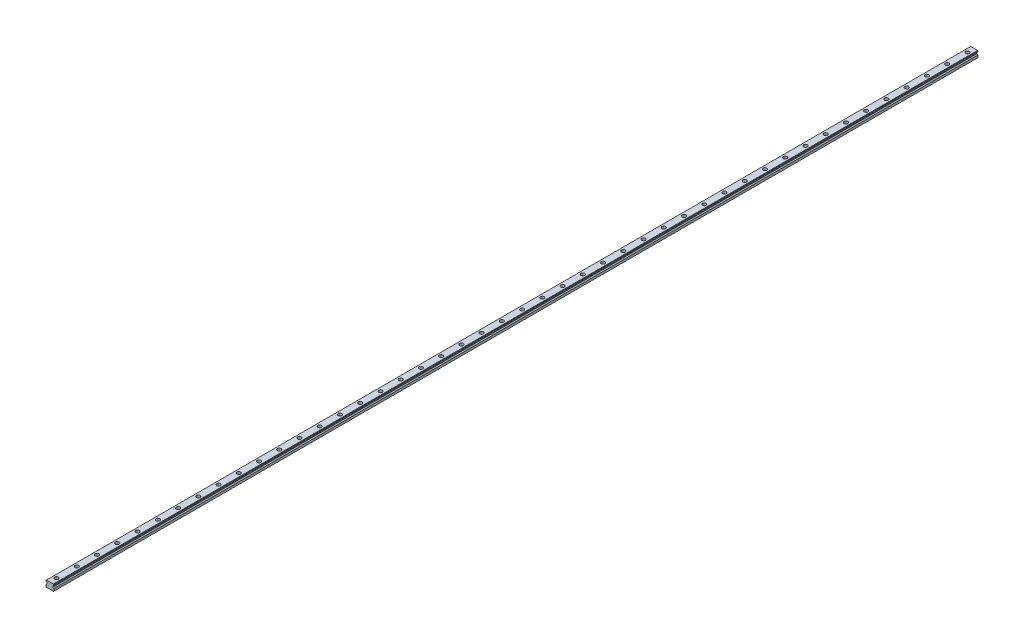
from build123d import *

# Parameters (mm, degrees)
SKETCH1_W           = 23
SKETCH1_H           = 19.2
BOSS_EXTRUDE1_DEPTH = 1370
CUT_EXTRUDE1_DEPTH  = 2741.09140176
CHAMFER1_SIZE       = 1.25
FILLET1_R           = 1.25
CUT_EXTRUDE2_DEPTH  = 2741.09140176
SKETCH4_R           = 5.5
SKETCH4_R_2         = 3.5
CUT_EXTRUDE3_DEPTH  = 9
SKETCH4_2_R         = 3.5
CUT_EXTRUDE4_DEPTH  = 1371.182794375
LPATTERN1_COUNT     = 46
LPATTERN1_PITCH     = 60


with BuildPart() as part:
    # Sketch1 → Boss-Extrude1 (new, symmetric)
    with BuildSketch(Plane.XY):
        with Locations((0, 9.6)):
            Rectangle(SKETCH1_W, SKETCH1_H)
    extrude(amount=BOSS_EXTRUDE1_DEPTH, both=True)

    # Sketch2 → Cut-Extrude1 (cut, through all)
    with BuildSketch(Plane.XY.offset(1370)):
        Polygon((-11.5, 16.7), (-11.5, 7.95), (-8.583333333, 10.866666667), (-8.583333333, 13.783333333), align=None)
        Polygon((8.583333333, 13.783333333), (11.5, 16.7), (11.5, 7.95), (8.583333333, 10.866666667), align=None)
    extrude(amount=-CUT_EXTRUDE1_DEPTH, mode=Mode.SUBTRACT)

    # Chamfer1
    chamfer1_edges = [part.edges().sort_by_distance(p)[0] for p in [
        (-11.5, 19.2, 0),
        (11.5, 19.2, 0),
        (11.5, 0, 0),
        (-11.5, 0, 0),
    ]]
    chamfer(chamfer1_edges, length=CHAMFER1_SIZE)

    # Fillet1
    fillet1_edges = [part.edges().sort_by_distance(p)[0] for p in [
        (-8.583333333, 13.783333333, 0),
        (-8.583333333, 10.866666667, 0),
        (8.583333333, 10.866666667, 0),
        (8.583333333, 13.783333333, 0),
    ]]
    fillet(fillet1_edges, radius=FILLET1_R)

    # Sketch3 → Cut-Extrude2 (cut, through all)
    with BuildSketch(Plane.XY.offset(1370)):
        Polygon((-7, 0), (-5.75, 1.25), (5.75, 1.25), (7, 0), align=None)
    extrude(amount=-CUT_EXTRUDE2_DEPTH, mode=Mode.SUBTRACT)

    # Sketch4 → Cut-Extrude3 (cut)
    with BuildSketch(Plane(origin=(0, 19.2, 0), x_dir=(1, 0, 0), z_dir=(0, 1, 0))):
        with Locations(Location((0, -1350, 0), (0, 0, 270))):
            Circle(SKETCH4_R)
        with Locations(Location((0, -1350, 0), (0, 0, 270))):
            Circle(SKETCH4_R_2, mode=Mode.SUBTRACT)
    cut_extrude3 = extrude(amount=-CUT_EXTRUDE3_DEPTH, mode=Mode.SUBTRACT)

    # Sketch4_2 → Cut-Extrude4 (cut, through all)
    with BuildSketch(Plane(origin=(0, 19.2, 0), x_dir=(1, 0, 0), z_dir=(0, 1, 0))):
        with Locations(Location((0, -1350, 0), (0, 0, 270))):
            Circle(SKETCH4_2_R)
    cut_extrude4 = extrude(amount=-CUT_EXTRUDE4_DEPTH, mode=Mode.SUBTRACT)

    # LPattern1: Cut-Extrude3, Cut-Extrude4 ×46
    with Locations(*[(0, 0, -i * LPATTERN1_PITCH) for i in range(1, LPATTERN1_COUNT)]):
        add(cut_extrude3, mode=Mode.SUBTRACT)
        add(cut_extrude4, mode=Mode.SUBTRACT)


solid = part.part
